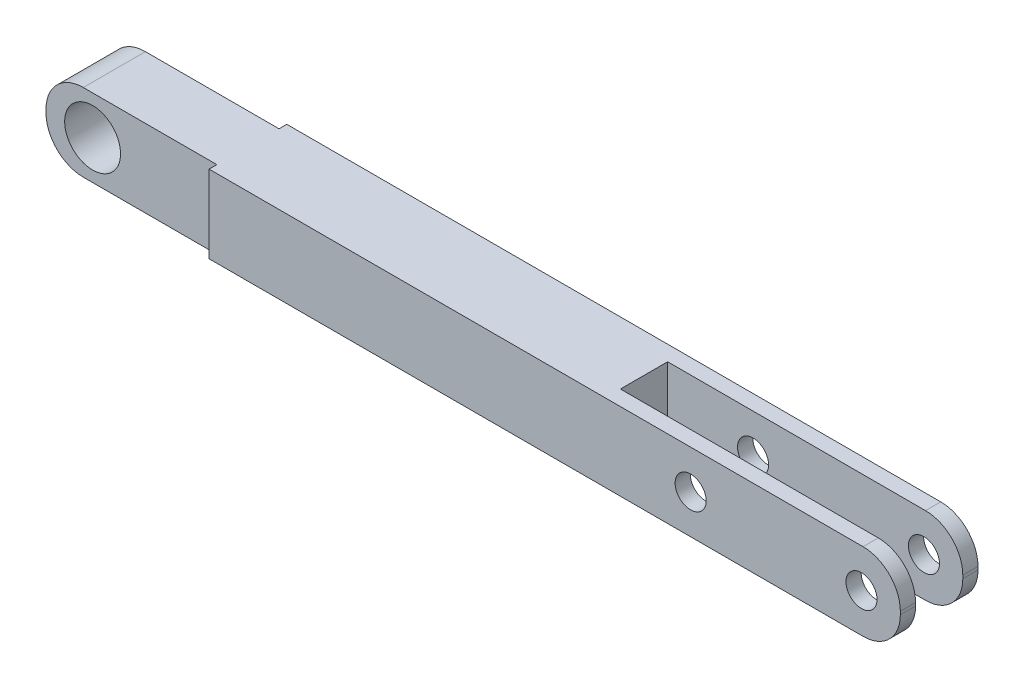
ISO-10303-21;
HEADER;
FILE_DESCRIPTION(('STEP AP214'),'2;1');
FILE_NAME('part.step','',(''),(''),'','','');
FILE_SCHEMA(('AUTOMOTIVE_DESIGN { 1 0 10303 214 1 1 1 1 }'));
ENDSEC;
DATA;
#1=APPLICATION_CONTEXT('core data for automotive mechanical design processes');
#2=APPLICATION_PROTOCOL_DEFINITION('international standard','automotive_design',2000,#1);
#3=PRODUCT_CONTEXT('',#1,'mechanical');
#4=PRODUCT('Part','Part','',(#3));
#5=PRODUCT_RELATED_PRODUCT_CATEGORY('part','',(#4));
#6=PRODUCT_DEFINITION_FORMATION('','',#4);
#7=PRODUCT_DEFINITION_CONTEXT('part definition',#1,'design');
#8=PRODUCT_DEFINITION('design','',#6,#7);
#9=PRODUCT_DEFINITION_SHAPE('','',#8);
#10=(LENGTH_UNIT() NAMED_UNIT(*) SI_UNIT(.MILLI.,.METRE.));
#11=(NAMED_UNIT(*) PLANE_ANGLE_UNIT() SI_UNIT($,.RADIAN.));
#12=(NAMED_UNIT(*) SI_UNIT($,.STERADIAN.) SOLID_ANGLE_UNIT());
#13=UNCERTAINTY_MEASURE_WITH_UNIT(LENGTH_MEASURE(1.E-05),#10,'distance_accuracy_value','');
#14=(GEOMETRIC_REPRESENTATION_CONTEXT(3) GLOBAL_UNCERTAINTY_ASSIGNED_CONTEXT((#13)) GLOBAL_UNIT_ASSIGNED_CONTEXT((#10,
#11,#12)) REPRESENTATION_CONTEXT('',''));
#15=CARTESIAN_POINT('',(0.,0.,0.));
#16=DIRECTION('',(0.,0.,1.));
#17=DIRECTION('',(1.,0.,0.));
#18=AXIS2_PLACEMENT_3D('',#15,#16,#17);
#19=CARTESIAN_POINT('',(-166.432963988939,13.,12.5));
#20=DIRECTION('',(0.,0.,-1.));
#21=DIRECTION('',(-1.,0.,0.));
#22=AXIS2_PLACEMENT_3D('',#19,#20,#21);
#23=CYLINDRICAL_SURFACE('',#22,12.);
#24=CARTESIAN_POINT('',(-166.432963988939,13.,2.5));
#25=DIRECTION('',(0.,0.,-1.));
#26=DIRECTION('',(-1.,0.,0.));
#27=AXIS2_PLACEMENT_3D('',#24,#25,#26);
#28=CIRCLE('',#27,12.);
#29=CARTESIAN_POINT('',(-178.432963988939,13.,2.5));
#30=VERTEX_POINT('',#29);
#31=CARTESIAN_POINT('',(-166.432963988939,25.,2.5));
#32=VERTEX_POINT('',#31);
#33=EDGE_CURVE('E545',#30,#32,#28,.T.);
#34=ORIENTED_EDGE('',*,*,#33,.F.);
#35=DIRECTION('',(0.,0.,-1.));
#36=VECTOR('',#35,1.);
#37=CARTESIAN_POINT('',(-178.432963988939,12.9999999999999,12.5));
#38=LINE('',#37,#36);
#39=CARTESIAN_POINT('',(-178.432963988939,13.,22.5));
#40=VERTEX_POINT('',#39);
#41=EDGE_CURVE('E11',#40,#30,#38,.T.);
#42=ORIENTED_EDGE('',*,*,#41,.F.);
#43=CARTESIAN_POINT('',(-166.432963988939,13.,22.5));
#44=DIRECTION('',(0.,0.,-1.));
#45=DIRECTION('',(-1.,0.,0.));
#46=AXIS2_PLACEMENT_3D('',#43,#44,#45);
#47=CIRCLE('',#46,12.);
#48=CARTESIAN_POINT('',(-166.432963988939,25.,22.5));
#49=VERTEX_POINT('',#48);
#50=EDGE_CURVE('E659',#40,#49,#47,.T.);
#51=ORIENTED_EDGE('',*,*,#50,.T.);
#52=DIRECTION('',(0.,0.,-1.));
#53=VECTOR('',#52,1.);
#54=CARTESIAN_POINT('',(-166.432963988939,25.,12.5));
#55=LINE('',#54,#53);
#56=EDGE_CURVE('E597',#49,#32,#55,.T.);
#57=ORIENTED_EDGE('',*,*,#56,.T.);
#58=EDGE_LOOP('',(#34,#42,#51,#57));
#59=FACE_BOUND('',#58,.T.);
#60=ADVANCED_FACE('F348',(#59),#23,.T.);
#61=CARTESIAN_POINT('',(-178.432963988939,12.9999999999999,12.5));
#62=DIRECTION('',(1.,0.,0.));
#63=DIRECTION('',(0.,0.,-1.));
#64=AXIS2_PLACEMENT_3D('',#61,#62,#63);
#65=PLANE('',#64);
#66=DIRECTION('',(0.,1.,0.));
#67=VECTOR('',#66,1.);
#68=CARTESIAN_POINT('',(-178.432963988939,12.9999999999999,2.5));
#69=LINE('',#68,#67);
#70=CARTESIAN_POINT('',(-178.432963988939,12.0000000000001,2.5));
#71=VERTEX_POINT('',#70);
#72=EDGE_CURVE('E547',#71,#30,#69,.T.);
#73=ORIENTED_EDGE('',*,*,#72,.F.);
#74=DIRECTION('',(0.,0.,-1.));
#75=VECTOR('',#74,1.);
#76=CARTESIAN_POINT('',(-178.432963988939,12.0000000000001,12.5));
#77=LINE('',#76,#75);
#78=CARTESIAN_POINT('',(-178.432963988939,12.0000000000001,22.5));
#79=VERTEX_POINT('',#78);
#80=EDGE_CURVE('E356',#79,#71,#77,.T.);
#81=ORIENTED_EDGE('',*,*,#80,.F.);
#82=DIRECTION('',(0.,1.,0.));
#83=VECTOR('',#82,1.);
#84=CARTESIAN_POINT('',(-178.432963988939,12.9999999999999,22.5));
#85=LINE('',#84,#83);
#86=EDGE_CURVE('E653',#79,#40,#85,.T.);
#87=ORIENTED_EDGE('',*,*,#86,.T.);
#88=ORIENTED_EDGE('',*,*,#41,.T.);
#89=EDGE_LOOP('',(#73,#81,#87,#88));
#90=FACE_BOUND('',#89,.T.);
#91=ADVANCED_FACE('F638',(#90),#65,.F.);
#92=CARTESIAN_POINT('',(-166.432963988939,12.,12.5));
#93=DIRECTION('',(0.,0.,-1.));
#94=DIRECTION('',(-1.,0.,0.));
#95=AXIS2_PLACEMENT_3D('',#92,#93,#94);
#96=CYLINDRICAL_SURFACE('',#95,12.);
#97=CARTESIAN_POINT('',(-166.432963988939,12.,2.5));
#98=DIRECTION('',(0.,0.,-1.));
#99=DIRECTION('',(-1.,0.,0.));
#100=AXIS2_PLACEMENT_3D('',#97,#98,#99);
#101=CIRCLE('',#100,12.);
#102=CARTESIAN_POINT('',(-166.432963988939,0.,2.5));
#103=VERTEX_POINT('',#102);
#104=EDGE_CURVE('E549',#103,#71,#101,.T.);
#105=ORIENTED_EDGE('',*,*,#104,.F.);
#106=DIRECTION('',(0.,0.,-1.));
#107=VECTOR('',#106,1.);
#108=CARTESIAN_POINT('',(-166.432963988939,0.,12.5));
#109=LINE('',#108,#107);
#110=CARTESIAN_POINT('',(-166.432963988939,0.,22.5));
#111=VERTEX_POINT('',#110);
#112=EDGE_CURVE('E608',#111,#103,#109,.T.);
#113=ORIENTED_EDGE('',*,*,#112,.F.);
#114=CARTESIAN_POINT('',(-166.432963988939,12.,22.5));
#115=DIRECTION('',(0.,0.,-1.));
#116=DIRECTION('',(-1.,0.,0.));
#117=AXIS2_PLACEMENT_3D('',#114,#115,#116);
#118=CIRCLE('',#117,12.);
#119=EDGE_CURVE('E658',#111,#79,#118,.T.);
#120=ORIENTED_EDGE('',*,*,#119,.T.);
#121=ORIENTED_EDGE('',*,*,#80,.T.);
#122=EDGE_LOOP('',(#105,#113,#120,#121));
#123=FACE_BOUND('',#122,.T.);
#124=ADVANCED_FACE('F644',(#123),#96,.T.);
#125=CARTESIAN_POINT('',(-163.432963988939,12.5,0.));
#126=DIRECTION('',(0.,0.,1.));
#127=DIRECTION('',(1.,0.,0.));
#128=AXIS2_PLACEMENT_3D('',#125,#126,#127);
#129=CYLINDRICAL_SURFACE('',#128,9.00000000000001);
#130=CARTESIAN_POINT('',(-163.432963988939,12.5,2.5));
#131=DIRECTION('',(0.,0.,-1.));
#132=DIRECTION('',(-1.,0.,0.));
#133=AXIS2_PLACEMENT_3D('',#130,#131,#132);
#134=CIRCLE('',#133,9.00000000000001);
#135=CARTESIAN_POINT('',(-172.432963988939,12.5,2.5));
#136=VERTEX_POINT('',#135);
#137=EDGE_CURVE('E351',#136,#136,#134,.F.);
#138=ORIENTED_EDGE('',*,*,#137,.F.);
#139=EDGE_LOOP('',(#138));
#140=FACE_BOUND('',#139,.T.);
#141=CARTESIAN_POINT('',(-163.432963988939,12.5,22.5));
#142=DIRECTION('',(0.,0.,-1.));
#143=DIRECTION('',(-1.,0.,0.));
#144=AXIS2_PLACEMENT_3D('',#141,#142,#143);
#145=CIRCLE('',#144,9.00000000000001);
#146=CARTESIAN_POINT('',(-172.432963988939,12.5,22.5));
#147=VERTEX_POINT('',#146);
#148=EDGE_CURVE('E535',#147,#147,#145,.F.);
#149=ORIENTED_EDGE('',*,*,#148,.T.);
#150=EDGE_LOOP('',(#149));
#151=FACE_BOUND('',#150,.T.);
#152=ADVANCED_FACE('F757',(#140,#151),#129,.F.);
#153=CARTESIAN_POINT('',(87.0670360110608,12.,12.5));
#154=DIRECTION('',(0.,0.,-1.));
#155=DIRECTION('',(-1.,0.,0.));
#156=AXIS2_PLACEMENT_3D('',#153,#154,#155);
#157=CYLINDRICAL_SURFACE('',#156,12.);
#158=CARTESIAN_POINT('',(87.0670360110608,12.,4.9));
#159=DIRECTION('',(0.,0.,1.));
#160=DIRECTION('',(1.,0.,0.));
#161=AXIS2_PLACEMENT_3D('',#158,#159,#160);
#162=CIRCLE('',#161,12.);
#163=CARTESIAN_POINT('',(87.0670360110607,0.,4.9));
#164=VERTEX_POINT('',#163);
#165=CARTESIAN_POINT('',(99.0670360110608,12.0000000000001,4.9));
#166=VERTEX_POINT('',#165);
#167=EDGE_CURVE('E570',#164,#166,#162,.T.);
#168=ORIENTED_EDGE('',*,*,#167,.F.);
#169=DIRECTION('',(0.,0.,-1.));
#170=VECTOR('',#169,1.);
#171=CARTESIAN_POINT('',(87.0670360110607,0.,12.5));
#172=LINE('',#171,#170);
#173=CARTESIAN_POINT('',(87.0670360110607,0.,0.));
#174=VERTEX_POINT('',#173);
#175=EDGE_CURVE('E605',#164,#174,#172,.T.);
#176=ORIENTED_EDGE('',*,*,#175,.T.);
#177=CARTESIAN_POINT('',(87.0670360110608,12.,0.));
#178=DIRECTION('',(0.,0.,1.));
#179=DIRECTION('',(-1.,0.,0.));
#180=AXIS2_PLACEMENT_3D('',#177,#178,#179);
#181=CIRCLE('',#180,12.);
#182=CARTESIAN_POINT('',(99.0670360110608,12.0000000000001,0.));
#183=VERTEX_POINT('',#182);
#184=EDGE_CURVE('E587',#174,#183,#181,.T.);
#185=ORIENTED_EDGE('',*,*,#184,.T.);
#186=DIRECTION('',(0.,0.,-1.));
#187=VECTOR('',#186,1.);
#188=CARTESIAN_POINT('',(99.0670360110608,12.0000000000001,12.5));
#189=LINE('',#188,#187);
#190=EDGE_CURVE('E603',#166,#183,#189,.T.);
#191=ORIENTED_EDGE('',*,*,#190,.F.);
#192=EDGE_LOOP('',(#168,#176,#185,#191));
#193=FACE_BOUND('',#192,.T.);
#194=ADVANCED_FACE('F738',(#193),#157,.T.);
#195=CARTESIAN_POINT('',(99.0670360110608,12.9999999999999,12.5));
#196=DIRECTION('',(-1.,0.,0.));
#197=DIRECTION('',(0.,0.,1.));
#198=AXIS2_PLACEMENT_3D('',#195,#196,#197);
#199=PLANE('',#198);
#200=DIRECTION('',(0.,1.,0.));
#201=VECTOR('',#200,1.);
#202=CARTESIAN_POINT('',(99.0670360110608,12.9999999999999,4.9));
#203=LINE('',#202,#201);
#204=CARTESIAN_POINT('',(99.0670360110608,13.,4.9));
#205=VERTEX_POINT('',#204);
#206=EDGE_CURVE('E568',#166,#205,#203,.T.);
#207=ORIENTED_EDGE('',*,*,#206,.F.);
#208=ORIENTED_EDGE('',*,*,#190,.T.);
#209=DIRECTION('',(0.,1.,0.));
#210=VECTOR('',#209,1.);
#211=CARTESIAN_POINT('',(99.0670360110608,12.9999999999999,0.));
#212=LINE('',#211,#210);
#213=CARTESIAN_POINT('',(99.0670360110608,12.9999999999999,0.));
#214=VERTEX_POINT('',#213);
#215=EDGE_CURVE('E590',#183,#214,#212,.T.);
#216=ORIENTED_EDGE('',*,*,#215,.T.);
#217=DIRECTION('',(0.,0.,-1.));
#218=VECTOR('',#217,1.);
#219=CARTESIAN_POINT('',(99.0670360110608,12.9999999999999,12.5));
#220=LINE('',#219,#218);
#221=EDGE_CURVE('E601',#205,#214,#220,.T.);
#222=ORIENTED_EDGE('',*,*,#221,.F.);
#223=EDGE_LOOP('',(#207,#208,#216,#222));
#224=FACE_BOUND('',#223,.T.);
#225=ADVANCED_FACE('F747',(#224),#199,.F.);
#226=CARTESIAN_POINT('',(87.0670360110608,13.,12.5));
#227=DIRECTION('',(0.,0.,-1.));
#228=DIRECTION('',(-1.,0.,0.));
#229=AXIS2_PLACEMENT_3D('',#226,#227,#228);
#230=CYLINDRICAL_SURFACE('',#229,12.);
#231=CARTESIAN_POINT('',(87.0670360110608,13.,4.9));
#232=DIRECTION('',(0.,0.,1.));
#233=DIRECTION('',(1.,0.,0.));
#234=AXIS2_PLACEMENT_3D('',#231,#232,#233);
#235=CIRCLE('',#234,12.);
#236=CARTESIAN_POINT('',(87.0670360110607,25.,4.9));
#237=VERTEX_POINT('',#236);
#238=EDGE_CURVE('E566',#205,#237,#235,.T.);
#239=ORIENTED_EDGE('',*,*,#238,.F.);
#240=ORIENTED_EDGE('',*,*,#221,.T.);
#241=CARTESIAN_POINT('',(87.0670360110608,13.,0.));
#242=DIRECTION('',(0.,0.,1.));
#243=DIRECTION('',(-1.,0.,0.));
#244=AXIS2_PLACEMENT_3D('',#241,#242,#243);
#245=CIRCLE('',#244,12.);
#246=CARTESIAN_POINT('',(87.0670360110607,25.,0.));
#247=VERTEX_POINT('',#246);
#248=EDGE_CURVE('E593',#214,#247,#245,.T.);
#249=ORIENTED_EDGE('',*,*,#248,.T.);
#250=DIRECTION('',(0.,0.,-1.));
#251=VECTOR('',#250,1.);
#252=CARTESIAN_POINT('',(87.0670360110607,25.,12.5));
#253=LINE('',#252,#251);
#254=EDGE_CURVE('E372',#237,#247,#253,.T.);
#255=ORIENTED_EDGE('',*,*,#254,.F.);
#256=EDGE_LOOP('',(#239,#240,#249,#255));
#257=FACE_BOUND('',#256,.T.);
#258=ADVANCED_FACE('F632',(#257),#230,.T.);
#259=CARTESIAN_POINT('',(86.5670360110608,12.5,0.));
#260=DIRECTION('',(0.,0.,1.));
#261=DIRECTION('',(1.,0.,0.));
#262=AXIS2_PLACEMENT_3D('',#259,#260,#261);
#263=CYLINDRICAL_SURFACE('',#262,5.);
#264=CARTESIAN_POINT('',(86.5670360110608,12.5,0.));
#265=DIRECTION('',(0.,0.,1.));
#266=DIRECTION('',(1.,0.,0.));
#267=AXIS2_PLACEMENT_3D('',#264,#265,#266);
#268=CIRCLE('',#267,5.);
#269=CARTESIAN_POINT('',(91.5670360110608,12.5,0.));
#270=VERTEX_POINT('',#269);
#271=EDGE_CURVE('E582',#270,#270,#268,.T.);
#272=ORIENTED_EDGE('',*,*,#271,.F.);
#273=EDGE_LOOP('',(#272));
#274=FACE_BOUND('',#273,.T.);
#275=CARTESIAN_POINT('',(86.5670360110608,12.5,4.9));
#276=DIRECTION('',(0.,0.,1.));
#277=DIRECTION('',(1.,0.,0.));
#278=AXIS2_PLACEMENT_3D('',#275,#276,#277);
#279=CIRCLE('',#278,5.);
#280=CARTESIAN_POINT('',(91.5670360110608,12.5,4.9));
#281=VERTEX_POINT('',#280);
#282=EDGE_CURVE('E561',#281,#281,#279,.F.);
#283=ORIENTED_EDGE('',*,*,#282,.F.);
#284=EDGE_LOOP('',(#283));
#285=FACE_BOUND('',#284,.T.);
#286=ADVANCED_FACE('F620',(#274,#285),#263,.F.);
#287=CARTESIAN_POINT('',(31.5670360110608,12.5,0.));
#288=DIRECTION('',(0.,0.,1.));
#289=DIRECTION('',(1.,0.,0.));
#290=AXIS2_PLACEMENT_3D('',#287,#288,#289);
#291=CYLINDRICAL_SURFACE('',#290,5.);
#292=CARTESIAN_POINT('',(31.5670360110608,12.5,0.));
#293=DIRECTION('',(0.,0.,1.));
#294=DIRECTION('',(1.,0.,0.));
#295=AXIS2_PLACEMENT_3D('',#292,#293,#294);
#296=CIRCLE('',#295,5.);
#297=CARTESIAN_POINT('',(36.5670360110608,12.5,0.));
#298=VERTEX_POINT('',#297);
#299=EDGE_CURVE('E579',#298,#298,#296,.T.);
#300=ORIENTED_EDGE('',*,*,#299,.F.);
#301=EDGE_LOOP('',(#300));
#302=FACE_BOUND('',#301,.T.);
#303=CARTESIAN_POINT('',(31.5670360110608,12.5,4.9));
#304=DIRECTION('',(0.,0.,1.));
#305=DIRECTION('',(1.,0.,0.));
#306=AXIS2_PLACEMENT_3D('',#303,#304,#305);
#307=CIRCLE('',#306,5.);
#308=CARTESIAN_POINT('',(36.5670360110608,12.5,4.9));
#309=VERTEX_POINT('',#308);
#310=EDGE_CURVE('E560',#309,#309,#307,.F.);
#311=ORIENTED_EDGE('',*,*,#310,.F.);
#312=EDGE_LOOP('',(#311));
#313=FACE_BOUND('',#312,.T.);
#314=ADVANCED_FACE('F618',(#302,#313),#291,.F.);
#315=CARTESIAN_POINT('',(-166.432963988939,0.,12.5));
#316=DIRECTION('',(0.,1.,0.));
#317=DIRECTION('',(0.,0.,1.));
#318=AXIS2_PLACEMENT_3D('',#315,#316,#317);
#319=PLANE('',#318);
#320=DIRECTION('',(-1.,0.,0.));
#321=VECTOR('',#320,1.);
#322=CARTESIAN_POINT('',(-166.432963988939,0.,2.5));
#323=LINE('',#322,#321);
#324=CARTESIAN_POINT('',(-123.432963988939,0.,2.5));
#325=VERTEX_POINT('',#324);
#326=EDGE_CURVE('E551',#325,#103,#323,.T.);
#327=ORIENTED_EDGE('',*,*,#326,.F.);
#328=DIRECTION('',(0.,0.,-1.));
#329=VECTOR('',#328,1.);
#330=CARTESIAN_POINT('',(-123.432963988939,0.,12.5));
#331=LINE('',#330,#329);
#332=CARTESIAN_POINT('',(-123.432963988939,0.,0.));
#333=VERTEX_POINT('',#332);
#334=EDGE_CURVE('E554',#325,#333,#331,.T.);
#335=ORIENTED_EDGE('',*,*,#334,.T.);
#336=DIRECTION('',(1.,0.,0.));
#337=VECTOR('',#336,1.);
#338=CARTESIAN_POINT('',(-166.432963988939,0.,0.));
#339=LINE('',#338,#337);
#340=EDGE_CURVE('E585',#333,#174,#339,.T.);
#341=ORIENTED_EDGE('',*,*,#340,.T.);
#342=ORIENTED_EDGE('',*,*,#175,.F.);
#343=DIRECTION('',(1.,0.,0.));
#344=VECTOR('',#343,1.);
#345=CARTESIAN_POINT('',(-166.432963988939,0.,4.9));
#346=LINE('',#345,#344);
#347=CARTESIAN_POINT('',(4.06703601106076,0.,4.9));
#348=VERTEX_POINT('',#347);
#349=EDGE_CURVE('E572',#348,#164,#346,.T.);
#350=ORIENTED_EDGE('',*,*,#349,.F.);
#351=DIRECTION('',(0.,0.,1.));
#352=VECTOR('',#351,1.);
#353=CARTESIAN_POINT('',(4.06703601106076,0.,12.5));
#354=LINE('',#353,#352);
#355=CARTESIAN_POINT('',(4.06703601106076,0.,20.1));
#356=VERTEX_POINT('',#355);
#357=EDGE_CURVE('E577',#348,#356,#354,.T.);
#358=ORIENTED_EDGE('',*,*,#357,.T.);
#359=DIRECTION('',(1.,0.,0.));
#360=VECTOR('',#359,1.);
#361=CARTESIAN_POINT('',(-166.432963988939,0.,20.1));
#362=LINE('',#361,#360);
#363=CARTESIAN_POINT('',(87.0670360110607,0.,20.1));
#364=VERTEX_POINT('',#363);
#365=EDGE_CURVE('E688',#356,#364,#362,.T.);
#366=ORIENTED_EDGE('',*,*,#365,.T.);
#367=DIRECTION('',(0.,0.,1.));
#368=VECTOR('',#367,1.);
#369=CARTESIAN_POINT('',(87.0670360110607,0.,12.5));
#370=LINE('',#369,#368);
#371=CARTESIAN_POINT('',(87.0670360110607,0.,25.));
#372=VERTEX_POINT('',#371);
#373=EDGE_CURVE('E503',#364,#372,#370,.T.);
#374=ORIENTED_EDGE('',*,*,#373,.T.);
#375=DIRECTION('',(1.,0.,0.));
#376=VECTOR('',#375,1.);
#377=CARTESIAN_POINT('',(-166.432963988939,0.,25.));
#378=LINE('',#377,#376);
#379=CARTESIAN_POINT('',(-123.432963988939,0.,25.));
#380=VERTEX_POINT('',#379);
#381=EDGE_CURVE('E482',#380,#372,#378,.T.);
#382=ORIENTED_EDGE('',*,*,#381,.F.);
#383=DIRECTION('',(0.,0.,1.));
#384=VECTOR('',#383,1.);
#385=CARTESIAN_POINT('',(-123.432963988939,0.,12.5));
#386=LINE('',#385,#384);
#387=CARTESIAN_POINT('',(-123.432963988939,0.,22.5));
#388=VERTEX_POINT('',#387);
#389=EDGE_CURVE('E492',#388,#380,#386,.T.);
#390=ORIENTED_EDGE('',*,*,#389,.F.);
#391=DIRECTION('',(-1.,0.,0.));
#392=VECTOR('',#391,1.);
#393=CARTESIAN_POINT('',(-166.432963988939,0.,22.5));
#394=LINE('',#393,#392);
#395=EDGE_CURVE('E669',#388,#111,#394,.T.);
#396=ORIENTED_EDGE('',*,*,#395,.T.);
#397=ORIENTED_EDGE('',*,*,#112,.T.);
#398=EDGE_LOOP('',(#327,#335,#341,#342,#350,#358,#366,#374,#382,#390,#396,#397));
#399=FACE_BOUND('',#398,.T.);
#400=ADVANCED_FACE('F501',(#399),#319,.F.);
#401=CARTESIAN_POINT('',(-166.432963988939,25.,12.5));
#402=DIRECTION('',(0.,-1.,0.));
#403=DIRECTION('',(0.,0.,-1.));
#404=AXIS2_PLACEMENT_3D('',#401,#402,#403);
#405=PLANE('',#404);
#406=DIRECTION('',(-1.,0.,0.));
#407=VECTOR('',#406,1.);
#408=CARTESIAN_POINT('',(-166.432963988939,25.,0.));
#409=LINE('',#408,#407);
#410=CARTESIAN_POINT('',(-123.432963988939,25.,0.));
#411=VERTEX_POINT('',#410);
#412=EDGE_CURVE('E595',#247,#411,#409,.T.);
#413=ORIENTED_EDGE('',*,*,#412,.T.);
#414=DIRECTION('',(0.,0.,1.));
#415=VECTOR('',#414,1.);
#416=CARTESIAN_POINT('',(-123.432963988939,25.,12.5));
#417=LINE('',#416,#415);
#418=CARTESIAN_POINT('',(-123.432963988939,25.,2.5));
#419=VERTEX_POINT('',#418);
#420=EDGE_CURVE('E364',#411,#419,#417,.T.);
#421=ORIENTED_EDGE('',*,*,#420,.T.);
#422=DIRECTION('',(1.,0.,0.));
#423=VECTOR('',#422,1.);
#424=CARTESIAN_POINT('',(-166.432963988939,25.,2.5));
#425=LINE('',#424,#423);
#426=EDGE_CURVE('E543',#32,#419,#425,.T.);
#427=ORIENTED_EDGE('',*,*,#426,.F.);
#428=ORIENTED_EDGE('',*,*,#56,.F.);
#429=DIRECTION('',(1.,0.,0.));
#430=VECTOR('',#429,1.);
#431=CARTESIAN_POINT('',(-166.432963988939,25.,22.5));
#432=LINE('',#431,#430);
#433=CARTESIAN_POINT('',(-123.432963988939,25.,22.5));
#434=VERTEX_POINT('',#433);
#435=EDGE_CURVE('E538',#49,#434,#432,.T.);
#436=ORIENTED_EDGE('',*,*,#435,.T.);
#437=DIRECTION('',(0.,0.,-1.));
#438=VECTOR('',#437,1.);
#439=CARTESIAN_POINT('',(-123.432963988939,25.,12.5));
#440=LINE('',#439,#438);
#441=CARTESIAN_POINT('',(-123.432963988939,25.,25.));
#442=VERTEX_POINT('',#441);
#443=EDGE_CURVE('E498',#442,#434,#440,.T.);
#444=ORIENTED_EDGE('',*,*,#443,.F.);
#445=DIRECTION('',(-1.,0.,0.));
#446=VECTOR('',#445,1.);
#447=CARTESIAN_POINT('',(-166.432963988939,25.,25.));
#448=LINE('',#447,#446);
#449=CARTESIAN_POINT('',(87.0670360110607,25.,25.));
#450=VERTEX_POINT('',#449);
#451=EDGE_CURVE('E485',#450,#442,#448,.T.);
#452=ORIENTED_EDGE('',*,*,#451,.F.);
#453=DIRECTION('',(0.,0.,1.));
#454=VECTOR('',#453,1.);
#455=CARTESIAN_POINT('',(87.0670360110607,25.,12.5));
#456=LINE('',#455,#454);
#457=CARTESIAN_POINT('',(87.0670360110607,25.,20.1));
#458=VERTEX_POINT('',#457);
#459=EDGE_CURVE('E520',#458,#450,#456,.T.);
#460=ORIENTED_EDGE('',*,*,#459,.F.);
#461=DIRECTION('',(-1.,0.,0.));
#462=VECTOR('',#461,1.);
#463=CARTESIAN_POINT('',(-166.432963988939,25.,20.1));
#464=LINE('',#463,#462);
#465=CARTESIAN_POINT('',(4.06703601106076,25.,20.1));
#466=VERTEX_POINT('',#465);
#467=EDGE_CURVE('E676',#458,#466,#464,.T.);
#468=ORIENTED_EDGE('',*,*,#467,.T.);
#469=DIRECTION('',(0.,0.,-1.));
#470=VECTOR('',#469,1.);
#471=CARTESIAN_POINT('',(4.06703601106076,25.,12.5));
#472=LINE('',#471,#470);
#473=CARTESIAN_POINT('',(4.06703601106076,25.,4.9));
#474=VERTEX_POINT('',#473);
#475=EDGE_CURVE('E574',#466,#474,#472,.T.);
#476=ORIENTED_EDGE('',*,*,#475,.T.);
#477=DIRECTION('',(-1.,0.,0.));
#478=VECTOR('',#477,1.);
#479=CARTESIAN_POINT('',(-166.432963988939,25.,4.9));
#480=LINE('',#479,#478);
#481=EDGE_CURVE('E564',#237,#474,#480,.T.);
#482=ORIENTED_EDGE('',*,*,#481,.F.);
#483=ORIENTED_EDGE('',*,*,#254,.T.);
#484=EDGE_LOOP('',(#413,#421,#427,#428,#436,#444,#452,#460,#468,#476,#482,#483));
#485=FACE_BOUND('',#484,.T.);
#486=ADVANCED_FACE('F629',(#485),#405,.F.);
#487=CARTESIAN_POINT('',(-166.432963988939,13.,0.));
#488=DIRECTION('',(0.,0.,-1.));
#489=DIRECTION('',(-1.,0.,0.));
#490=AXIS2_PLACEMENT_3D('',#487,#488,#489);
#491=PLANE('',#490);
#492=DIRECTION('',(0.,-1.,0.));
#493=VECTOR('',#492,1.);
#494=CARTESIAN_POINT('',(-123.432963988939,-10.2442736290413,0.));
#495=LINE('',#494,#493);
#496=EDGE_CURVE('E530',#411,#333,#495,.T.);
#497=ORIENTED_EDGE('',*,*,#496,.F.);
#498=ORIENTED_EDGE('',*,*,#412,.F.);
#499=ORIENTED_EDGE('',*,*,#248,.F.);
#500=ORIENTED_EDGE('',*,*,#215,.F.);
#501=ORIENTED_EDGE('',*,*,#184,.F.);
#502=ORIENTED_EDGE('',*,*,#340,.F.);
#503=EDGE_LOOP('',(#497,#498,#499,#500,#501,#502));
#504=FACE_BOUND('',#503,.T.);
#505=ORIENTED_EDGE('',*,*,#299,.T.);
#506=EDGE_LOOP('',(#505));
#507=FACE_BOUND('',#506,.T.);
#508=ORIENTED_EDGE('',*,*,#271,.T.);
#509=EDGE_LOOP('',(#508));
#510=FACE_BOUND('',#509,.T.);
#511=ADVANCED_FACE('F730',(#504,#507,#510),#491,.T.);
#512=CARTESIAN_POINT('',(4.06703601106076,42.3905612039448,4.9));
#513=DIRECTION('',(-1.,0.,0.));
#514=DIRECTION('',(0.,-1.,0.));
#515=AXIS2_PLACEMENT_3D('',#512,#513,#514);
#516=PLANE('',#515);
#517=DIRECTION('',(0.,-1.,0.));
#518=VECTOR('',#517,1.);
#519=CARTESIAN_POINT('',(4.06703601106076,42.3905612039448,4.9));
#520=LINE('',#519,#518);
#521=EDGE_CURVE('E557',#474,#348,#520,.T.);
#522=ORIENTED_EDGE('',*,*,#521,.F.);
#523=ORIENTED_EDGE('',*,*,#475,.F.);
#524=DIRECTION('',(0.,-1.,0.));
#525=VECTOR('',#524,1.);
#526=CARTESIAN_POINT('',(4.06703601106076,42.3905612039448,20.1));
#527=LINE('',#526,#525);
#528=EDGE_CURVE('E497',#466,#356,#527,.T.);
#529=ORIENTED_EDGE('',*,*,#528,.T.);
#530=ORIENTED_EDGE('',*,*,#357,.F.);
#531=EDGE_LOOP('',(#522,#523,#529,#530));
#532=FACE_BOUND('',#531,.T.);
#533=ADVANCED_FACE('F742',(#532),#516,.F.);
#534=CARTESIAN_POINT('',(4.06703601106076,-18.1257413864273,4.9));
#535=DIRECTION('',(0.,0.,1.));
#536=DIRECTION('',(1.,0.,0.));
#537=AXIS2_PLACEMENT_3D('',#534,#535,#536);
#538=PLANE('',#537);
#539=ORIENTED_EDGE('',*,*,#282,.T.);
#540=EDGE_LOOP('',(#539));
#541=FACE_BOUND('',#540,.T.);
#542=ORIENTED_EDGE('',*,*,#310,.T.);
#543=EDGE_LOOP('',(#542));
#544=FACE_BOUND('',#543,.T.);
#545=ORIENTED_EDGE('',*,*,#349,.T.);
#546=ORIENTED_EDGE('',*,*,#167,.T.);
#547=ORIENTED_EDGE('',*,*,#206,.T.);
#548=ORIENTED_EDGE('',*,*,#238,.T.);
#549=ORIENTED_EDGE('',*,*,#481,.T.);
#550=ORIENTED_EDGE('',*,*,#521,.T.);
#551=EDGE_LOOP('',(#545,#546,#547,#548,#549,#550));
#552=FACE_BOUND('',#551,.T.);
#553=ADVANCED_FACE('F615',(#541,#544,#552),#538,.T.);
#554=CARTESIAN_POINT('',(-123.432963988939,-10.2442736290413,2.5));
#555=DIRECTION('',(1.,0.,0.));
#556=DIRECTION('',(0.,0.,-1.));
#557=AXIS2_PLACEMENT_3D('',#554,#555,#556);
#558=PLANE('',#557);
#559=DIRECTION('',(0.,-1.,0.));
#560=VECTOR('',#559,1.);
#561=CARTESIAN_POINT('',(-123.432963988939,-10.2442736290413,2.5));
#562=LINE('',#561,#560);
#563=EDGE_CURVE('E540',#419,#325,#562,.T.);
#564=ORIENTED_EDGE('',*,*,#563,.F.);
#565=ORIENTED_EDGE('',*,*,#420,.F.);
#566=ORIENTED_EDGE('',*,*,#496,.T.);
#567=ORIENTED_EDGE('',*,*,#334,.F.);
#568=EDGE_LOOP('',(#564,#565,#566,#567));
#569=FACE_BOUND('',#568,.T.);
#570=ADVANCED_FACE('F725',(#569),#558,.F.);
#571=CARTESIAN_POINT('',(-208.179412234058,40.4893691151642,2.5));
#572=DIRECTION('',(0.,0.,-1.));
#573=DIRECTION('',(-1.,0.,0.));
#574=AXIS2_PLACEMENT_3D('',#571,#572,#573);
#575=PLANE('',#574);
#576=ORIENTED_EDGE('',*,*,#137,.T.);
#577=EDGE_LOOP('',(#576));
#578=FACE_BOUND('',#577,.T.);
#579=ORIENTED_EDGE('',*,*,#326,.T.);
#580=ORIENTED_EDGE('',*,*,#104,.T.);
#581=ORIENTED_EDGE('',*,*,#72,.T.);
#582=ORIENTED_EDGE('',*,*,#33,.T.);
#583=ORIENTED_EDGE('',*,*,#426,.T.);
#584=ORIENTED_EDGE('',*,*,#563,.T.);
#585=EDGE_LOOP('',(#579,#580,#581,#582,#583,#584));
#586=FACE_BOUND('',#585,.T.);
#587=ADVANCED_FACE('F724',(#578,#586),#575,.T.);
#588=CARTESIAN_POINT('',(87.0670360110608,12.,12.5));
#589=DIRECTION('',(0.,0.,1.));
#590=DIRECTION('',(-1.,0.,0.));
#591=AXIS2_PLACEMENT_3D('',#588,#589,#590);
#592=CYLINDRICAL_SURFACE('',#591,12.);
#593=CARTESIAN_POINT('',(87.0670360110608,12.,20.1));
#594=DIRECTION('',(0.,0.,1.));
#595=DIRECTION('',(1.,0.,0.));
#596=AXIS2_PLACEMENT_3D('',#593,#594,#595);
#597=CIRCLE('',#596,12.);
#598=CARTESIAN_POINT('',(99.0670360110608,12.0000000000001,20.1));
#599=VERTEX_POINT('',#598);
#600=EDGE_CURVE('E685',#364,#599,#597,.T.);
#601=ORIENTED_EDGE('',*,*,#600,.T.);
#602=DIRECTION('',(0.,0.,1.));
#603=VECTOR('',#602,1.);
#604=CARTESIAN_POINT('',(99.0670360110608,12.0000000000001,12.5));
#605=LINE('',#604,#603);
#606=CARTESIAN_POINT('',(99.0670360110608,12.0000000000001,25.));
#607=VERTEX_POINT('',#606);
#608=EDGE_CURVE('E526',#599,#607,#605,.T.);
#609=ORIENTED_EDGE('',*,*,#608,.T.);
#610=CARTESIAN_POINT('',(87.0670360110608,12.,25.));
#611=DIRECTION('',(0.,0.,1.));
#612=DIRECTION('',(-1.,0.,0.));
#613=AXIS2_PLACEMENT_3D('',#610,#611,#612);
#614=CIRCLE('',#613,12.);
#615=EDGE_CURVE('E505',#372,#607,#614,.T.);
#616=ORIENTED_EDGE('',*,*,#615,.F.);
#617=ORIENTED_EDGE('',*,*,#373,.F.);
#618=EDGE_LOOP('',(#601,#609,#616,#617));
#619=FACE_BOUND('',#618,.T.);
#620=ADVANCED_FACE('F717',(#619),#592,.T.);
#621=CARTESIAN_POINT('',(99.0670360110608,12.9999999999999,12.5));
#622=DIRECTION('',(-1.,0.,0.));
#623=DIRECTION('',(0.,0.,-1.));
#624=AXIS2_PLACEMENT_3D('',#621,#622,#623);
#625=PLANE('',#624);
#626=DIRECTION('',(0.,1.,0.));
#627=VECTOR('',#626,1.);
#628=CARTESIAN_POINT('',(99.0670360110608,12.9999999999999,20.1));
#629=LINE('',#628,#627);
#630=CARTESIAN_POINT('',(99.0670360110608,13.,20.1));
#631=VERTEX_POINT('',#630);
#632=EDGE_CURVE('E682',#599,#631,#629,.T.);
#633=ORIENTED_EDGE('',*,*,#632,.T.);
#634=DIRECTION('',(0.,0.,1.));
#635=VECTOR('',#634,1.);
#636=CARTESIAN_POINT('',(99.0670360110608,12.9999999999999,12.5));
#637=LINE('',#636,#635);
#638=CARTESIAN_POINT('',(99.0670360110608,12.9999999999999,25.));
#639=VERTEX_POINT('',#638);
#640=EDGE_CURVE('E523',#631,#639,#637,.T.);
#641=ORIENTED_EDGE('',*,*,#640,.T.);
#642=DIRECTION('',(0.,1.,0.));
#643=VECTOR('',#642,1.);
#644=CARTESIAN_POINT('',(99.0670360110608,12.9999999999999,25.));
#645=LINE('',#644,#643);
#646=EDGE_CURVE('E508',#607,#639,#645,.T.);
#647=ORIENTED_EDGE('',*,*,#646,.F.);
#648=ORIENTED_EDGE('',*,*,#608,.F.);
#649=EDGE_LOOP('',(#633,#641,#647,#648));
#650=FACE_BOUND('',#649,.T.);
#651=ADVANCED_FACE('F721',(#650),#625,.F.);
#652=CARTESIAN_POINT('',(87.0670360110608,13.,12.5));
#653=DIRECTION('',(0.,0.,1.));
#654=DIRECTION('',(-1.,0.,0.));
#655=AXIS2_PLACEMENT_3D('',#652,#653,#654);
#656=CYLINDRICAL_SURFACE('',#655,12.);
#657=CARTESIAN_POINT('',(87.0670360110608,13.,20.1));
#658=DIRECTION('',(0.,0.,1.));
#659=DIRECTION('',(1.,0.,0.));
#660=AXIS2_PLACEMENT_3D('',#657,#658,#659);
#661=CIRCLE('',#660,12.);
#662=EDGE_CURVE('E679',#631,#458,#661,.T.);
#663=ORIENTED_EDGE('',*,*,#662,.T.);
#664=ORIENTED_EDGE('',*,*,#459,.T.);
#665=CARTESIAN_POINT('',(87.0670360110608,13.,25.));
#666=DIRECTION('',(0.,0.,1.));
#667=DIRECTION('',(-1.,0.,0.));
#668=AXIS2_PLACEMENT_3D('',#665,#666,#667);
#669=CIRCLE('',#668,12.);
#670=EDGE_CURVE('E517',#639,#450,#669,.T.);
#671=ORIENTED_EDGE('',*,*,#670,.F.);
#672=ORIENTED_EDGE('',*,*,#640,.F.);
#673=EDGE_LOOP('',(#663,#664,#671,#672));
#674=FACE_BOUND('',#673,.T.);
#675=ADVANCED_FACE('F703',(#674),#656,.T.);
#676=CARTESIAN_POINT('',(86.5670360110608,12.5,25.));
#677=DIRECTION('',(0.,0.,-1.));
#678=DIRECTION('',(1.,0.,0.));
#679=AXIS2_PLACEMENT_3D('',#676,#677,#678);
#680=CYLINDRICAL_SURFACE('',#679,5.);
#681=CARTESIAN_POINT('',(86.5670360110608,12.5,25.));
#682=DIRECTION('',(0.,0.,1.));
#683=DIRECTION('',(1.,0.,0.));
#684=AXIS2_PLACEMENT_3D('',#681,#682,#683);
#685=CIRCLE('',#684,5.);
#686=CARTESIAN_POINT('',(91.5670360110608,12.5,25.));
#687=VERTEX_POINT('',#686);
#688=EDGE_CURVE('E506',#687,#687,#685,.T.);
#689=ORIENTED_EDGE('',*,*,#688,.T.);
#690=EDGE_LOOP('',(#689));
#691=FACE_BOUND('',#690,.T.);
#692=CARTESIAN_POINT('',(86.5670360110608,12.5,20.1));
#693=DIRECTION('',(0.,0.,1.));
#694=DIRECTION('',(1.,0.,0.));
#695=AXIS2_PLACEMENT_3D('',#692,#693,#694);
#696=CIRCLE('',#695,5.);
#697=CARTESIAN_POINT('',(91.5670360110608,12.5,20.1));
#698=VERTEX_POINT('',#697);
#699=EDGE_CURVE('E534',#698,#698,#696,.F.);
#700=ORIENTED_EDGE('',*,*,#699,.T.);
#701=EDGE_LOOP('',(#700));
#702=FACE_BOUND('',#701,.T.);
#703=ADVANCED_FACE('F700',(#691,#702),#680,.F.);
#704=CARTESIAN_POINT('',(31.5670360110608,12.5,25.));
#705=DIRECTION('',(0.,0.,-1.));
#706=DIRECTION('',(1.,0.,0.));
#707=AXIS2_PLACEMENT_3D('',#704,#705,#706);
#708=CYLINDRICAL_SURFACE('',#707,5.);
#709=CARTESIAN_POINT('',(31.5670360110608,12.5,25.));
#710=DIRECTION('',(0.,0.,1.));
#711=DIRECTION('',(1.,0.,0.));
#712=AXIS2_PLACEMENT_3D('',#709,#710,#711);
#713=CIRCLE('',#712,5.);
#714=CARTESIAN_POINT('',(36.5670360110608,12.5,25.));
#715=VERTEX_POINT('',#714);
#716=EDGE_CURVE('E511',#715,#715,#713,.T.);
#717=ORIENTED_EDGE('',*,*,#716,.T.);
#718=EDGE_LOOP('',(#717));
#719=FACE_BOUND('',#718,.T.);
#720=CARTESIAN_POINT('',(31.5670360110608,12.5,20.1));
#721=DIRECTION('',(0.,0.,1.));
#722=DIRECTION('',(1.,0.,0.));
#723=AXIS2_PLACEMENT_3D('',#720,#721,#722);
#724=CIRCLE('',#723,5.);
#725=CARTESIAN_POINT('',(36.5670360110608,12.5,20.1));
#726=VERTEX_POINT('',#725);
#727=EDGE_CURVE('E531',#726,#726,#724,.F.);
#728=ORIENTED_EDGE('',*,*,#727,.T.);
#729=EDGE_LOOP('',(#728));
#730=FACE_BOUND('',#729,.T.);
#731=ADVANCED_FACE('F692',(#719,#730),#708,.F.);
#732=CARTESIAN_POINT('',(-166.432963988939,13.,25.));
#733=DIRECTION('',(0.,0.,1.));
#734=DIRECTION('',(-1.,0.,0.));
#735=AXIS2_PLACEMENT_3D('',#732,#733,#734);
#736=PLANE('',#735);
#737=DIRECTION('',(0.,-1.,0.));
#738=VECTOR('',#737,1.);
#739=CARTESIAN_POINT('',(-123.432963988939,-10.2442736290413,25.));
#740=LINE('',#739,#738);
#741=EDGE_CURVE('E476',#442,#380,#740,.T.);
#742=ORIENTED_EDGE('',*,*,#741,.T.);
#743=ORIENTED_EDGE('',*,*,#381,.T.);
#744=ORIENTED_EDGE('',*,*,#615,.T.);
#745=ORIENTED_EDGE('',*,*,#646,.T.);
#746=ORIENTED_EDGE('',*,*,#670,.T.);
#747=ORIENTED_EDGE('',*,*,#451,.T.);
#748=EDGE_LOOP('',(#742,#743,#744,#745,#746,#747));
#749=FACE_BOUND('',#748,.T.);
#750=ORIENTED_EDGE('',*,*,#716,.F.);
#751=EDGE_LOOP('',(#750));
#752=FACE_BOUND('',#751,.T.);
#753=ORIENTED_EDGE('',*,*,#688,.F.);
#754=EDGE_LOOP('',(#753));
#755=FACE_BOUND('',#754,.T.);
#756=ADVANCED_FACE('F478',(#749,#752,#755),#736,.T.);
#757=CARTESIAN_POINT('',(4.06703601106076,-18.1257413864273,20.1));
#758=DIRECTION('',(0.,0.,-1.));
#759=DIRECTION('',(1.,0.,0.));
#760=AXIS2_PLACEMENT_3D('',#757,#758,#759);
#761=PLANE('',#760);
#762=ORIENTED_EDGE('',*,*,#699,.F.);
#763=EDGE_LOOP('',(#762));
#764=FACE_BOUND('',#763,.T.);
#765=ORIENTED_EDGE('',*,*,#727,.F.);
#766=EDGE_LOOP('',(#765));
#767=FACE_BOUND('',#766,.T.);
#768=ORIENTED_EDGE('',*,*,#365,.F.);
#769=ORIENTED_EDGE('',*,*,#528,.F.);
#770=ORIENTED_EDGE('',*,*,#467,.F.);
#771=ORIENTED_EDGE('',*,*,#662,.F.);
#772=ORIENTED_EDGE('',*,*,#632,.F.);
#773=ORIENTED_EDGE('',*,*,#600,.F.);
#774=EDGE_LOOP('',(#768,#769,#770,#771,#772,#773));
#775=FACE_BOUND('',#774,.T.);
#776=ADVANCED_FACE('F696',(#764,#767,#775),#761,.T.);
#777=CARTESIAN_POINT('',(-123.432963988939,-10.2442736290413,22.5));
#778=DIRECTION('',(1.,0.,0.));
#779=DIRECTION('',(0.,0.,1.));
#780=AXIS2_PLACEMENT_3D('',#777,#778,#779);
#781=PLANE('',#780);
#782=DIRECTION('',(0.,-1.,0.));
#783=VECTOR('',#782,1.);
#784=CARTESIAN_POINT('',(-123.432963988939,-10.2442736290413,22.5));
#785=LINE('',#784,#783);
#786=EDGE_CURVE('E489',#434,#388,#785,.T.);
#787=ORIENTED_EDGE('',*,*,#786,.T.);
#788=ORIENTED_EDGE('',*,*,#389,.T.);
#789=ORIENTED_EDGE('',*,*,#741,.F.);
#790=ORIENTED_EDGE('',*,*,#443,.T.);
#791=EDGE_LOOP('',(#787,#788,#789,#790));
#792=FACE_BOUND('',#791,.T.);
#793=ADVANCED_FACE('F493',(#792),#781,.F.);
#794=CARTESIAN_POINT('',(-208.179412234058,40.4893691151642,22.5));
#795=DIRECTION('',(0.,0.,1.));
#796=DIRECTION('',(-1.,0.,0.));
#797=AXIS2_PLACEMENT_3D('',#794,#795,#796);
#798=PLANE('',#797);
#799=ORIENTED_EDGE('',*,*,#148,.F.);
#800=EDGE_LOOP('',(#799));
#801=FACE_BOUND('',#800,.T.);
#802=ORIENTED_EDGE('',*,*,#395,.F.);
#803=ORIENTED_EDGE('',*,*,#786,.F.);
#804=ORIENTED_EDGE('',*,*,#435,.F.);
#805=ORIENTED_EDGE('',*,*,#50,.F.);
#806=ORIENTED_EDGE('',*,*,#86,.F.);
#807=ORIENTED_EDGE('',*,*,#119,.F.);
#808=EDGE_LOOP('',(#802,#803,#804,#805,#806,#807));
#809=FACE_BOUND('',#808,.T.);
#810=ADVANCED_FACE('F662',(#801,#809),#798,.T.);
#811=CLOSED_SHELL('',(#60,#91,#124,#152,#194,#225,#258,#286,#314,#400,#486,#511,#533,#553,#570,
#587,#620,#651,#675,#703,#731,#756,#776,#793,#810));
#812=MANIFOLD_SOLID_BREP('B2',#811);
#813=ADVANCED_BREP_SHAPE_REPRESENTATION('',(#18,#812),#14);
#814=SHAPE_DEFINITION_REPRESENTATION(#9,#813);
ENDSEC;
END-ISO-10303-21;
